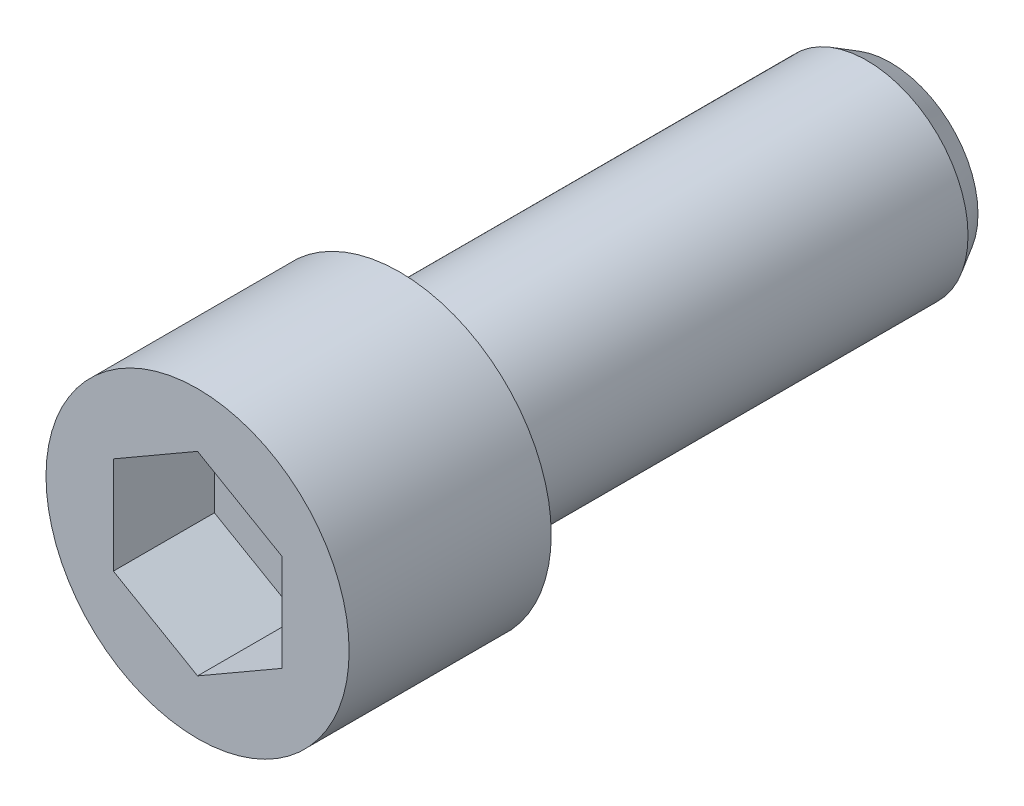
ISO-10303-21;
HEADER;
FILE_DESCRIPTION(('STEP AP214'),'2;1');
FILE_NAME('part.step','',(''),(''),'','','');
FILE_SCHEMA(('AUTOMOTIVE_DESIGN { 1 0 10303 214 1 1 1 1 }'));
ENDSEC;
DATA;
#1=APPLICATION_CONTEXT('core data for automotive mechanical design processes');
#2=APPLICATION_PROTOCOL_DEFINITION('international standard','automotive_design',2000,#1);
#3=PRODUCT_CONTEXT('',#1,'mechanical');
#4=PRODUCT('Part','Part','',(#3));
#5=PRODUCT_RELATED_PRODUCT_CATEGORY('part','',(#4));
#6=PRODUCT_DEFINITION_FORMATION('','',#4);
#7=PRODUCT_DEFINITION_CONTEXT('part definition',#1,'design');
#8=PRODUCT_DEFINITION('design','',#6,#7);
#9=PRODUCT_DEFINITION_SHAPE('','',#8);
#10=(LENGTH_UNIT() NAMED_UNIT(*) SI_UNIT(.MILLI.,.METRE.));
#11=(NAMED_UNIT(*) PLANE_ANGLE_UNIT() SI_UNIT($,.RADIAN.));
#12=(NAMED_UNIT(*) SI_UNIT($,.STERADIAN.) SOLID_ANGLE_UNIT());
#13=UNCERTAINTY_MEASURE_WITH_UNIT(LENGTH_MEASURE(1.E-05),#10,'distance_accuracy_value','');
#14=(GEOMETRIC_REPRESENTATION_CONTEXT(3) GLOBAL_UNCERTAINTY_ASSIGNED_CONTEXT((#13)) GLOBAL_UNIT_ASSIGNED_CONTEXT((#10,
#11,#12)) REPRESENTATION_CONTEXT('',''));
#15=CARTESIAN_POINT('',(0.,0.,0.));
#16=DIRECTION('',(0.,0.,1.));
#17=DIRECTION('',(1.,0.,0.));
#18=AXIS2_PLACEMENT_3D('',#15,#16,#17);
#19=CARTESIAN_POINT('',(0.,0.,2.35));
#20=DIRECTION('',(0.,0.,-1.));
#21=DIRECTION('',(1.,0.,0.));
#22=AXIS2_PLACEMENT_3D('',#19,#20,#21);
#23=SPHERICAL_SURFACE('',#22,4.35);
#24=CARTESIAN_POINT('',(0.,0.,0.85));
#25=DIRECTION('',(0.,0.,-1.));
#26=DIRECTION('',(1.,0.,0.));
#27=AXIS2_PLACEMENT_3D('',#24,#25,#26);
#28=CIRCLE('',#27,4.08319727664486);
#29=CARTESIAN_POINT('',(4.08319727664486,0.,0.85));
#30=VERTEX_POINT('',#29);
#31=EDGE_CURVE('E9',#30,#30,#28,.T.);
#32=CARTESIAN_POINT('',(0.,0.,0.));
#33=DIRECTION('',(0.,0.,-1.));
#34=DIRECTION('',(1.,0.,0.));
#35=AXIS2_PLACEMENT_3D('',#32,#33,#34);
#36=CIRCLE('',#35,3.66060104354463);
#37=CARTESIAN_POINT('',(3.66060104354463,0.,0.));
#38=VERTEX_POINT('',#37);
#39=EDGE_CURVE('E17',#38,#38,#36,.F.);
#40=CARTESIAN_POINT('',(4.08319727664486,0.,0.85));
#41=CARTESIAN_POINT('',(4.07978079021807,0.,0.840699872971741));
#42=CARTESIAN_POINT('',(4.07633252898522,0.,0.831411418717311));
#43=CARTESIAN_POINT('',(4.06937262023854,0.,0.812858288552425));
#44=CARTESIAN_POINT('',(4.06586097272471,0.,0.803593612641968));
#45=CARTESIAN_POINT('',(4.0587744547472,0.,0.785088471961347));
#46=CARTESIAN_POINT('',(4.05519958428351,0.,0.775848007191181));
#47=CARTESIAN_POINT('',(4.04798678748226,0.,0.757391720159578));
#48=CARTESIAN_POINT('',(4.04434886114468,0.,0.74817589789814));
#49=CARTESIAN_POINT('',(4.03701012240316,0.,0.729769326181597));
#50=CARTESIAN_POINT('',(4.03330930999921,0.,0.720578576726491));
#51=CARTESIAN_POINT('',(4.0258449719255,0.,0.702222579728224));
#52=CARTESIAN_POINT('',(4.02208144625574,0.,0.693057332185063));
#53=CARTESIAN_POINT('',(4.01449185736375,0.,0.674752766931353));
#54=CARTESIAN_POINT('',(4.01066579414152,0.,0.665613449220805));
#55=CARTESIAN_POINT('',(4.00295130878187,0.,0.647361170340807));
#56=CARTESIAN_POINT('',(3.99906288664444,0.,0.638248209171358));
#57=CARTESIAN_POINT('',(3.99122386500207,0.,0.620049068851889));
#58=CARTESIAN_POINT('',(3.98727326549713,0.,0.610962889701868));
#59=CARTESIAN_POINT('',(3.9793100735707,0.,0.592817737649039));
#60=CARTESIAN_POINT('',(3.97529748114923,0.,0.58375876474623));
#61=CARTESIAN_POINT('',(3.96721049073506,0.,0.565668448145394));
#62=CARTESIAN_POINT('',(3.96313609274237,0.,0.556637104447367));
#63=CARTESIAN_POINT('',(3.95492568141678,0.,0.538602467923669));
#64=CARTESIAN_POINT('',(3.95078966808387,0.,0.529599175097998));
#65=CARTESIAN_POINT('',(3.94245621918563,0.,0.51162106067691));
#66=CARTESIAN_POINT('',(3.9382587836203,0.,0.502646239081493));
#67=CARTESIAN_POINT('',(3.92980268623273,0.,0.484725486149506));
#68=CARTESIAN_POINT('',(3.9255440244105,0.,0.475779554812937));
#69=CARTESIAN_POINT('',(3.9169656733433,0.,0.457917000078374));
#70=CARTESIAN_POINT('',(3.91264598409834,0.,0.44900037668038));
#71=CARTESIAN_POINT('',(3.90394577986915,0.,0.431196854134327));
#72=CARTESIAN_POINT('',(3.89956526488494,0.,0.422309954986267));
#73=CARTESIAN_POINT('',(3.89074361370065,0.,0.404566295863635));
#74=CARTESIAN_POINT('',(3.88630247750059,0.,0.395709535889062));
#75=CARTESIAN_POINT('',(3.87735979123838,0.,0.378026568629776));
#76=CARTESIAN_POINT('',(3.87285824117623,0.,0.369200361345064));
#77=CARTESIAN_POINT('',(3.8637949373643,0.,0.351578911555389));
#78=CARTESIAN_POINT('',(3.85923318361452,0.,0.342783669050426));
#79=CARTESIAN_POINT('',(3.85004968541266,0.,0.325224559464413));
#80=CARTESIAN_POINT('',(3.84542794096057,0.,0.316460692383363));
#81=CARTESIAN_POINT('',(3.83612467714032,0.,0.298964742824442));
#82=CARTESIAN_POINT('',(3.83144315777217,0.,0.290232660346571));
#83=CARTESIAN_POINT('',(3.82202056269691,0.,0.272800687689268));
#84=CARTESIAN_POINT('',(3.8172794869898,0.,0.264100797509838));
#85=CARTESIAN_POINT('',(3.80773800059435,0.,0.246733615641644));
#86=CARTESIAN_POINT('',(3.80293758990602,0.,0.238066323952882));
#87=CARTESIAN_POINT('',(3.79327765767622,0.,0.220764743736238));
#88=CARTESIAN_POINT('',(3.78841813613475,0.,0.212130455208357));
#89=CARTESIAN_POINT('',(3.77864020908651,0.,0.194895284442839));
#90=CARTESIAN_POINT('',(3.77372180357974,0.,0.186294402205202));
#91=CARTESIAN_POINT('',(3.76382633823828,0.,0.169126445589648));
#92=CARTESIAN_POINT('',(3.75884927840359,0.,0.160559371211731));
#93=CARTESIAN_POINT('',(3.7488367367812,0.,0.143459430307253));
#94=CARTESIAN_POINT('',(3.7438012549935,0.,0.134926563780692));
#95=CARTESIAN_POINT('',(3.73367210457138,0.,0.117895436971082));
#96=CARTESIAN_POINT('',(3.72857843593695,0.,0.109397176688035));
#97=CARTESIAN_POINT('',(3.7183331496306,0.,0.0924356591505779));
#98=CARTESIAN_POINT('',(3.71318153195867,0.,0.0839724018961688));
#99=CARTESIAN_POINT('',(3.70282058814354,0.,0.0670812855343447));
#100=CARTESIAN_POINT('',(3.69761126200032,0.,0.0586534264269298));
#101=CARTESIAN_POINT('',(3.6871351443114,0.,0.0418334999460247));
#102=CARTESIAN_POINT('',(3.68186835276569,0.,0.0334414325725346));
#103=CARTESIAN_POINT('',(3.67127755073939,0.,0.0166934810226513));
#104=CARTESIAN_POINT('',(3.66595354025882,0.,0.00833759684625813));
#105=CARTESIAN_POINT('',(3.66060104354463,0.,0.));
#106=B_SPLINE_CURVE_WITH_KNOTS('',3,(#40,#41,#42,#43,#44,#45,#46,#47,#48,#49,#50,#51,#52,#53,
#54,#55,#56,#57,#58,#59,#60,#61,#62,#63,#64,#65,#66,#67,#68,#69,#70,#71,#72,#73,#74,#75,#76,#77,
#78,#79,#80,#81,#82,#83,#84,#85,#86,#87,#88,#89,#90,#91,#92,#93,#94,#95,#96,#97,#98,#99,#100,
#101,#102,#103,#104,#105),.UNSPECIFIED.,.F.,.F.,(4,2,2,2,2,2,2,2,2,2,2,2,2,2,2,2,2,2,2,2,2,2,2,
2,2,2,2,2,2,2,2,2,4),(0.,0.0297233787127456,0.0594467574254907,0.0891701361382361,
0.118893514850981,0.148616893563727,0.178340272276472,0.208063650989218,0.237787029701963,
0.267510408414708,0.297233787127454,0.326957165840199,0.356680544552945,0.38640392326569,
0.416127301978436,0.445850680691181,0.475574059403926,0.505297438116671,0.535020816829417,
0.564744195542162,0.594467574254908,0.624190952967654,0.653914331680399,0.683637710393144,
0.71336108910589,0.743084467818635,0.77280784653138,0.802531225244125,0.832254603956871,
0.861977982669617,0.891701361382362,0.921424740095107,0.951148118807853),.UNSPECIFIED.);
#107=EDGE_CURVE('BSEAM14',#30,#38,#106,.T.);
#108=ORIENTED_EDGE('',*,*,#31,.T.);
#109=ORIENTED_EDGE('',*,*,#39,.T.);
#110=ORIENTED_EDGE('',*,*,#107,.T.);
#111=ORIENTED_EDGE('',*,*,#107,.F.);
#112=EDGE_LOOP('',(#108,#110,#109,#111));
#113=FACE_BOUND('',#112,.T.);
#114=ADVANCED_FACE('F14',(#113),#23,.T.);
#115=CARTESIAN_POINT('',(5.19170962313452,0.,0.85));
#116=DIRECTION('',(0.,0.,1.));
#117=DIRECTION('',(-1.,0.,0.));
#118=AXIS2_PLACEMENT_3D('',#115,#116,#117);
#119=PLANE('',#118);
#120=ORIENTED_EDGE('',*,*,#31,.F.);
#121=EDGE_LOOP('',(#120));
#122=FACE_BOUND('',#121,.T.);
#123=CARTESIAN_POINT('',(0.,0.,0.85));
#124=DIRECTION('',(0.,0.,-1.));
#125=DIRECTION('',(1.,0.,0.));
#126=AXIS2_PLACEMENT_3D('',#123,#124,#125);
#127=CIRCLE('',#126,5.19170962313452);
#128=CARTESIAN_POINT('',(5.19170962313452,0.,0.85));
#129=VERTEX_POINT('',#128);
#130=EDGE_CURVE('E22',#129,#129,#127,.T.);
#131=ORIENTED_EDGE('',*,*,#130,.T.);
#132=EDGE_LOOP('',(#131));
#133=FACE_BOUND('',#132,.T.);
#134=ADVANCED_FACE('F137',(#122,#133),#119,.F.);
#135=CARTESIAN_POINT('',(0.,0.,2.25));
#136=DIRECTION('',(0.,0.,1.));
#137=DIRECTION('',(-1.,0.,0.));
#138=AXIS2_PLACEMENT_3D('',#135,#136,#137);
#139=CONICAL_SURFACE('',#138,6.,0.523598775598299);
#140=ORIENTED_EDGE('',*,*,#130,.F.);
#141=EDGE_LOOP('',(#140));
#142=FACE_BOUND('',#141,.T.);
#143=CARTESIAN_POINT('',(0.,0.,2.25));
#144=DIRECTION('',(0.,0.,-1.));
#145=DIRECTION('',(1.,0.,0.));
#146=AXIS2_PLACEMENT_3D('',#143,#144,#145);
#147=CIRCLE('',#146,6.);
#148=CARTESIAN_POINT('',(6.,0.,2.25));
#149=VERTEX_POINT('',#148);
#150=EDGE_CURVE('E131',#149,#149,#147,.T.);
#151=ORIENTED_EDGE('',*,*,#150,.T.);
#152=EDGE_LOOP('',(#151));
#153=FACE_BOUND('',#152,.T.);
#154=ADVANCED_FACE('F139',(#142,#153),#139,.T.);
#155=CARTESIAN_POINT('',(0.,0.,-20.));
#156=DIRECTION('',(0.,0.,-1.));
#157=DIRECTION('',(1.,0.,0.));
#158=AXIS2_PLACEMENT_3D('',#155,#156,#157);
#159=CYLINDRICAL_SURFACE('',#158,6.);
#160=CARTESIAN_POINT('',(0.,0.,30.));
#161=DIRECTION('',(0.,0.,-1.));
#162=DIRECTION('',(1.,0.,0.));
#163=AXIS2_PLACEMENT_3D('',#160,#161,#162);
#164=CIRCLE('',#163,6.);
#165=CARTESIAN_POINT('',(6.,0.,30.));
#166=VERTEX_POINT('',#165);
#167=EDGE_CURVE('E128',#166,#166,#164,.T.);
#168=ORIENTED_EDGE('',*,*,#167,.T.);
#169=EDGE_LOOP('',(#168));
#170=FACE_BOUND('',#169,.T.);
#171=ORIENTED_EDGE('',*,*,#150,.F.);
#172=EDGE_LOOP('',(#171));
#173=FACE_BOUND('',#172,.T.);
#174=ADVANCED_FACE('F142',(#170,#173),#159,.T.);
#175=CARTESIAN_POINT('',(6.,0.,30.));
#176=DIRECTION('',(0.,0.,-1.));
#177=DIRECTION('',(1.,0.,0.));
#178=AXIS2_PLACEMENT_3D('',#175,#176,#177);
#179=PLANE('',#178);
#180=CARTESIAN_POINT('',(0.,0.,30.));
#181=DIRECTION('',(0.,0.,-1.));
#182=DIRECTION('',(1.,0.,0.));
#183=AXIS2_PLACEMENT_3D('',#180,#181,#182);
#184=CIRCLE('',#183,9.);
#185=CARTESIAN_POINT('',(9.,0.,30.));
#186=VERTEX_POINT('',#185);
#187=EDGE_CURVE('E125',#186,#186,#184,.T.);
#188=ORIENTED_EDGE('',*,*,#187,.T.);
#189=EDGE_LOOP('',(#188));
#190=FACE_BOUND('',#189,.T.);
#191=ORIENTED_EDGE('',*,*,#167,.F.);
#192=EDGE_LOOP('',(#191));
#193=FACE_BOUND('',#192,.T.);
#194=ADVANCED_FACE('F147',(#190,#193),#179,.T.);
#195=CARTESIAN_POINT('',(0.,0.,-20.));
#196=DIRECTION('',(0.,0.,-1.));
#197=DIRECTION('',(1.,0.,0.));
#198=AXIS2_PLACEMENT_3D('',#195,#196,#197);
#199=CYLINDRICAL_SURFACE('',#198,9.);
#200=CARTESIAN_POINT('',(0.,0.,42.));
#201=DIRECTION('',(0.,0.,-1.));
#202=DIRECTION('',(1.,0.,0.));
#203=AXIS2_PLACEMENT_3D('',#200,#201,#202);
#204=CIRCLE('',#203,9.);
#205=CARTESIAN_POINT('',(9.,0.,42.));
#206=VERTEX_POINT('',#205);
#207=EDGE_CURVE('E122',#206,#206,#204,.T.);
#208=ORIENTED_EDGE('',*,*,#207,.T.);
#209=EDGE_LOOP('',(#208));
#210=FACE_BOUND('',#209,.T.);
#211=ORIENTED_EDGE('',*,*,#187,.F.);
#212=EDGE_LOOP('',(#211));
#213=FACE_BOUND('',#212,.T.);
#214=ADVANCED_FACE('F154',(#210,#213),#199,.T.);
#215=CARTESIAN_POINT('',(9.,0.,42.));
#216=DIRECTION('',(0.,0.,1.));
#217=DIRECTION('',(-1.,0.,0.));
#218=AXIS2_PLACEMENT_3D('',#215,#216,#217);
#219=PLANE('',#218);
#220=DIRECTION('',(-0.86602540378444,0.5,0.));
#221=VECTOR('',#220,1.);
#222=CARTESIAN_POINT('',(5.,2.88675134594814,42.));
#223=LINE('',#222,#221);
#224=CARTESIAN_POINT('',(5.,2.88675134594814,42.));
#225=VERTEX_POINT('',#224);
#226=CARTESIAN_POINT('',(0.,5.77350269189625,42.));
#227=VERTEX_POINT('',#226);
#228=EDGE_CURVE('E29',#225,#227,#223,.T.);
#229=ORIENTED_EDGE('',*,*,#228,.F.);
#230=DIRECTION('',(0.,1.,0.));
#231=VECTOR('',#230,1.);
#232=CARTESIAN_POINT('',(5.,-2.88675134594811,42.));
#233=LINE('',#232,#231);
#234=CARTESIAN_POINT('',(5.,-2.88675134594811,42.));
#235=VERTEX_POINT('',#234);
#236=EDGE_CURVE('E98',#235,#225,#233,.T.);
#237=ORIENTED_EDGE('',*,*,#236,.F.);
#238=DIRECTION('',(-0.866025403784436,-0.5,0.));
#239=VECTOR('',#238,1.);
#240=CARTESIAN_POINT('',(5.,-2.88675134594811,42.));
#241=LINE('',#240,#239);
#242=CARTESIAN_POINT('',(0.,-5.77350269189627,42.));
#243=VERTEX_POINT('',#242);
#244=EDGE_CURVE('E93',#235,#243,#241,.T.);
#245=ORIENTED_EDGE('',*,*,#244,.T.);
#246=DIRECTION('',(0.866025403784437,-0.5,0.));
#247=VECTOR('',#246,1.);
#248=CARTESIAN_POINT('',(-5.,-2.88675134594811,42.));
#249=LINE('',#248,#247);
#250=CARTESIAN_POINT('',(-5.,-2.88675134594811,42.));
#251=VERTEX_POINT('',#250);
#252=EDGE_CURVE('E91',#251,#243,#249,.T.);
#253=ORIENTED_EDGE('',*,*,#252,.F.);
#254=DIRECTION('',(0.,1.,0.));
#255=VECTOR('',#254,1.);
#256=CARTESIAN_POINT('',(-5.,-2.88675134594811,42.));
#257=LINE('',#256,#255);
#258=CARTESIAN_POINT('',(-5.,2.88675134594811,42.));
#259=VERTEX_POINT('',#258);
#260=EDGE_CURVE('E72',#251,#259,#257,.T.);
#261=ORIENTED_EDGE('',*,*,#260,.T.);
#262=DIRECTION('',(0.866025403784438,0.5,0.));
#263=VECTOR('',#262,1.);
#264=CARTESIAN_POINT('',(-5.,2.88675134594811,42.));
#265=LINE('',#264,#263);
#266=EDGE_CURVE('E83',#259,#227,#265,.T.);
#267=ORIENTED_EDGE('',*,*,#266,.T.);
#268=EDGE_LOOP('',(#229,#237,#245,#253,#261,#267));
#269=FACE_BOUND('',#268,.T.);
#270=ORIENTED_EDGE('',*,*,#207,.F.);
#271=EDGE_LOOP('',(#270));
#272=FACE_BOUND('',#271,.T.);
#273=ADVANCED_FACE('F87',(#269,#272),#219,.T.);
#274=CARTESIAN_POINT('',(5.,2.88675134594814,36.));
#275=DIRECTION('',(0.5,0.86602540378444,0.));
#276=DIRECTION('',(0.86602540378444,-0.5,0.));
#277=AXIS2_PLACEMENT_3D('',#274,#275,#276);
#278=PLANE('',#277);
#279=DIRECTION('',(0.,0.,1.));
#280=VECTOR('',#279,1.);
#281=CARTESIAN_POINT('',(5.,2.88675134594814,36.));
#282=LINE('',#281,#280);
#283=CARTESIAN_POINT('',(5.,2.88675134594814,36.));
#284=VERTEX_POINT('',#283);
#285=EDGE_CURVE('E36',#284,#225,#282,.T.);
#286=ORIENTED_EDGE('',*,*,#285,.T.);
#287=ORIENTED_EDGE('',*,*,#228,.T.);
#288=DIRECTION('',(0.,0.,1.));
#289=VECTOR('',#288,1.);
#290=CARTESIAN_POINT('',(0.,5.77350269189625,36.));
#291=LINE('',#290,#289);
#292=CARTESIAN_POINT('',(0.,5.77350269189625,36.));
#293=VERTEX_POINT('',#292);
#294=EDGE_CURVE('E80',#293,#227,#291,.T.);
#295=ORIENTED_EDGE('',*,*,#294,.F.);
#296=DIRECTION('',(-0.86602540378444,0.5,0.));
#297=VECTOR('',#296,1.);
#298=CARTESIAN_POINT('',(5.,2.88675134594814,36.));
#299=LINE('',#298,#297);
#300=EDGE_CURVE('E100',#284,#293,#299,.T.);
#301=ORIENTED_EDGE('',*,*,#300,.F.);
#302=EDGE_LOOP('',(#286,#287,#295,#301));
#303=FACE_BOUND('',#302,.T.);
#304=ADVANCED_FACE('F185',(#303),#278,.F.);
#305=CARTESIAN_POINT('',(5.,-2.88675134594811,36.));
#306=DIRECTION('',(1.,0.,0.));
#307=DIRECTION('',(0.,-1.,0.));
#308=AXIS2_PLACEMENT_3D('',#305,#306,#307);
#309=PLANE('',#308);
#310=DIRECTION('',(0.,0.,1.));
#311=VECTOR('',#310,1.);
#312=CARTESIAN_POINT('',(5.,-2.88675134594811,36.));
#313=LINE('',#312,#311);
#314=CARTESIAN_POINT('',(5.,-2.88675134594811,36.));
#315=VERTEX_POINT('',#314);
#316=EDGE_CURVE('E119',#315,#235,#313,.T.);
#317=ORIENTED_EDGE('',*,*,#316,.T.);
#318=ORIENTED_EDGE('',*,*,#236,.T.);
#319=ORIENTED_EDGE('',*,*,#285,.F.);
#320=DIRECTION('',(0.,1.,0.));
#321=VECTOR('',#320,1.);
#322=CARTESIAN_POINT('',(5.,-2.88675134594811,36.));
#323=LINE('',#322,#321);
#324=EDGE_CURVE('E112',#315,#284,#323,.T.);
#325=ORIENTED_EDGE('',*,*,#324,.F.);
#326=EDGE_LOOP('',(#317,#318,#319,#325));
#327=FACE_BOUND('',#326,.T.);
#328=ADVANCED_FACE('F193',(#327),#309,.F.);
#329=CARTESIAN_POINT('',(5.,-2.88675134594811,36.));
#330=DIRECTION('',(-0.5,0.866025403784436,0.));
#331=DIRECTION('',(0.866025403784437,0.5,0.));
#332=AXIS2_PLACEMENT_3D('',#329,#330,#331);
#333=PLANE('',#332);
#334=DIRECTION('',(0.,0.,1.));
#335=VECTOR('',#334,1.);
#336=CARTESIAN_POINT('',(0.,-5.77350269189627,36.));
#337=LINE('',#336,#335);
#338=CARTESIAN_POINT('',(0.,-5.77350269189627,36.));
#339=VERTEX_POINT('',#338);
#340=EDGE_CURVE('E117',#339,#243,#337,.T.);
#341=ORIENTED_EDGE('',*,*,#340,.T.);
#342=ORIENTED_EDGE('',*,*,#244,.F.);
#343=ORIENTED_EDGE('',*,*,#316,.F.);
#344=DIRECTION('',(-0.866025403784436,-0.5,0.));
#345=VECTOR('',#344,1.);
#346=CARTESIAN_POINT('',(5.,-2.88675134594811,36.));
#347=LINE('',#346,#345);
#348=EDGE_CURVE('E109',#315,#339,#347,.T.);
#349=ORIENTED_EDGE('',*,*,#348,.T.);
#350=EDGE_LOOP('',(#341,#342,#343,#349));
#351=FACE_BOUND('',#350,.T.);
#352=ADVANCED_FACE('F189',(#351),#333,.T.);
#353=CARTESIAN_POINT('',(-5.,-2.88675134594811,36.));
#354=DIRECTION('',(-0.5,-0.866025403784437,0.));
#355=DIRECTION('',(-0.866025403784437,0.5,0.));
#356=AXIS2_PLACEMENT_3D('',#353,#354,#355);
#357=PLANE('',#356);
#358=DIRECTION('',(0.,0.,1.));
#359=VECTOR('',#358,1.);
#360=CARTESIAN_POINT('',(-5.,-2.88675134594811,36.));
#361=LINE('',#360,#359);
#362=CARTESIAN_POINT('',(-5.,-2.88675134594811,36.));
#363=VERTEX_POINT('',#362);
#364=EDGE_CURVE('E79',#363,#251,#361,.T.);
#365=ORIENTED_EDGE('',*,*,#364,.T.);
#366=ORIENTED_EDGE('',*,*,#252,.T.);
#367=ORIENTED_EDGE('',*,*,#340,.F.);
#368=DIRECTION('',(0.866025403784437,-0.5,0.));
#369=VECTOR('',#368,1.);
#370=CARTESIAN_POINT('',(-5.,-2.88675134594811,36.));
#371=LINE('',#370,#369);
#372=EDGE_CURVE('E106',#363,#339,#371,.T.);
#373=ORIENTED_EDGE('',*,*,#372,.F.);
#374=EDGE_LOOP('',(#365,#366,#367,#373));
#375=FACE_BOUND('',#374,.T.);
#376=ADVANCED_FACE('F182',(#375),#357,.F.);
#377=CARTESIAN_POINT('',(-5.,-2.88675134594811,36.));
#378=DIRECTION('',(1.,0.,0.));
#379=DIRECTION('',(0.,-1.,0.));
#380=AXIS2_PLACEMENT_3D('',#377,#378,#379);
#381=PLANE('',#380);
#382=DIRECTION('',(0.,0.,1.));
#383=VECTOR('',#382,1.);
#384=CARTESIAN_POINT('',(-5.,2.88675134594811,36.));
#385=LINE('',#384,#383);
#386=CARTESIAN_POINT('',(-5.,2.88675134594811,36.));
#387=VERTEX_POINT('',#386);
#388=EDGE_CURVE('E68',#387,#259,#385,.T.);
#389=ORIENTED_EDGE('',*,*,#388,.T.);
#390=ORIENTED_EDGE('',*,*,#260,.F.);
#391=ORIENTED_EDGE('',*,*,#364,.F.);
#392=DIRECTION('',(0.,1.,0.));
#393=VECTOR('',#392,1.);
#394=CARTESIAN_POINT('',(-5.,-2.88675134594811,36.));
#395=LINE('',#394,#393);
#396=EDGE_CURVE('E75',#363,#387,#395,.T.);
#397=ORIENTED_EDGE('',*,*,#396,.T.);
#398=EDGE_LOOP('',(#389,#390,#391,#397));
#399=FACE_BOUND('',#398,.T.);
#400=ADVANCED_FACE('F70',(#399),#381,.T.);
#401=CARTESIAN_POINT('',(-5.,2.88675134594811,36.));
#402=DIRECTION('',(0.5,-0.866025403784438,0.));
#403=DIRECTION('',(-0.866025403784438,-0.5,0.));
#404=AXIS2_PLACEMENT_3D('',#401,#402,#403);
#405=PLANE('',#404);
#406=DIRECTION('',(0.866025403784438,0.5,0.));
#407=VECTOR('',#406,1.);
#408=CARTESIAN_POINT('',(-5.,2.88675134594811,36.));
#409=LINE('',#408,#407);
#410=EDGE_CURVE('E103',#387,#293,#409,.T.);
#411=ORIENTED_EDGE('',*,*,#410,.T.);
#412=ORIENTED_EDGE('',*,*,#294,.T.);
#413=ORIENTED_EDGE('',*,*,#266,.F.);
#414=ORIENTED_EDGE('',*,*,#388,.F.);
#415=EDGE_LOOP('',(#411,#412,#413,#414));
#416=FACE_BOUND('',#415,.T.);
#417=ADVANCED_FACE('F84',(#416),#405,.T.);
#418=CARTESIAN_POINT('',(-5.,8.66025403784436,36.));
#419=DIRECTION('',(0.,0.,-1.));
#420=DIRECTION('',(1.,0.,0.));
#421=AXIS2_PLACEMENT_3D('',#418,#419,#420);
#422=PLANE('',#421);
#423=ORIENTED_EDGE('',*,*,#300,.T.);
#424=ORIENTED_EDGE('',*,*,#410,.F.);
#425=ORIENTED_EDGE('',*,*,#396,.F.);
#426=ORIENTED_EDGE('',*,*,#372,.T.);
#427=ORIENTED_EDGE('',*,*,#348,.F.);
#428=ORIENTED_EDGE('',*,*,#324,.T.);
#429=EDGE_LOOP('',(#423,#424,#425,#426,#427,#428));
#430=FACE_BOUND('',#429,.T.);
#431=ADVANCED_FACE('F170',(#430),#422,.F.);
#432=CARTESIAN_POINT('',(0.,0.,0.));
#433=DIRECTION('',(0.,0.,-1.));
#434=DIRECTION('',(1.,0.,0.));
#435=AXIS2_PLACEMENT_3D('',#432,#433,#434);
#436=PLANE('',#435);
#437=ORIENTED_EDGE('',*,*,#39,.F.);
#438=EDGE_LOOP('',(#437));
#439=FACE_BOUND('',#438,.T.);
#440=ADVANCED_FACE('F168',(#439),#436,.T.);
#441=CLOSED_SHELL('',(#114,#134,#154,#174,#194,#214,#273,#304,#328,#352,#376,#400,#417,#431,#440));
#442=MANIFOLD_SOLID_BREP('B1',#441);
#443=ADVANCED_BREP_SHAPE_REPRESENTATION('',(#18,#442),#14);
#444=SHAPE_DEFINITION_REPRESENTATION(#9,#443);
ENDSEC;
END-ISO-10303-21;
